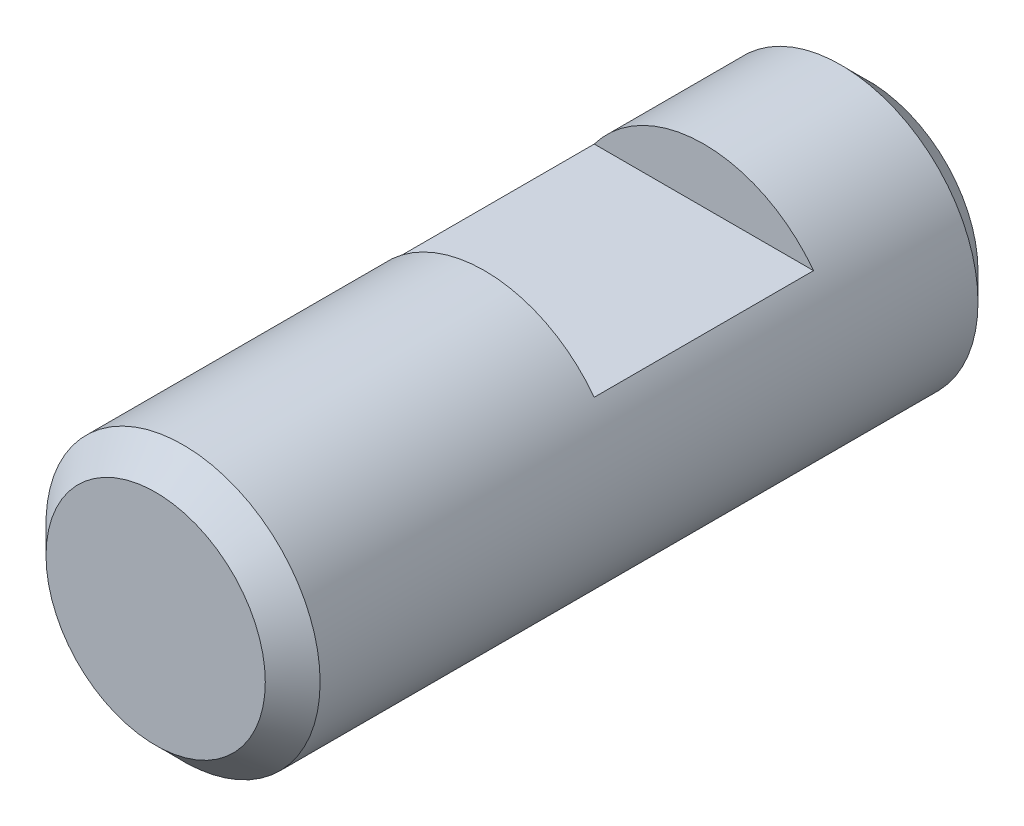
ISO-10303-21;
HEADER;
FILE_DESCRIPTION(('STEP AP214'),'2;1');
FILE_NAME('part.step','',(''),(''),'','','');
FILE_SCHEMA(('AUTOMOTIVE_DESIGN { 1 0 10303 214 1 1 1 1 }'));
ENDSEC;
DATA;
#1=APPLICATION_CONTEXT('core data for automotive mechanical design processes');
#2=APPLICATION_PROTOCOL_DEFINITION('international standard','automotive_design',2000,#1);
#3=PRODUCT_CONTEXT('',#1,'mechanical');
#4=PRODUCT('Part','Part','',(#3));
#5=PRODUCT_RELATED_PRODUCT_CATEGORY('part','',(#4));
#6=PRODUCT_DEFINITION_FORMATION('','',#4);
#7=PRODUCT_DEFINITION_CONTEXT('part definition',#1,'design');
#8=PRODUCT_DEFINITION('design','',#6,#7);
#9=PRODUCT_DEFINITION_SHAPE('','',#8);
#10=(LENGTH_UNIT() NAMED_UNIT(*) SI_UNIT(.MILLI.,.METRE.));
#11=(NAMED_UNIT(*) PLANE_ANGLE_UNIT() SI_UNIT($,.RADIAN.));
#12=(NAMED_UNIT(*) SI_UNIT($,.STERADIAN.) SOLID_ANGLE_UNIT());
#13=UNCERTAINTY_MEASURE_WITH_UNIT(LENGTH_MEASURE(1.E-05),#10,'distance_accuracy_value','');
#14=(GEOMETRIC_REPRESENTATION_CONTEXT(3) GLOBAL_UNCERTAINTY_ASSIGNED_CONTEXT((#13)) GLOBAL_UNIT_ASSIGNED_CONTEXT((#10,
#11,#12)) REPRESENTATION_CONTEXT('',''));
#15=CARTESIAN_POINT('',(0.,0.,0.));
#16=DIRECTION('',(0.,0.,1.));
#17=DIRECTION('',(1.,0.,0.));
#18=AXIS2_PLACEMENT_3D('',#15,#16,#17);
#19=CARTESIAN_POINT('',(0.,0.,26.));
#20=DIRECTION('',(0.,0.,-1.));
#21=DIRECTION('',(-1.,0.,0.));
#22=AXIS2_PLACEMENT_3D('',#19,#20,#21);
#23=CYLINDRICAL_SURFACE('',#22,5.);
#24=CARTESIAN_POINT('',(0.,0.,25.));
#25=DIRECTION('',(0.,0.,1.));
#26=DIRECTION('',(1.,0.,0.));
#27=AXIS2_PLACEMENT_3D('',#24,#25,#26);
#28=CIRCLE('',#27,5.);
#29=CARTESIAN_POINT('',(5.,0.,25.));
#30=VERTEX_POINT('',#29);
#31=EDGE_CURVE('E11',#30,#30,#28,.F.);
#32=ORIENTED_EDGE('',*,*,#31,.T.);
#33=EDGE_LOOP('',(#32));
#34=FACE_BOUND('',#33,.T.);
#35=CARTESIAN_POINT('',(0.,0.,1.00000000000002));
#36=DIRECTION('',(0.,0.,1.));
#37=DIRECTION('',(1.,0.,0.));
#38=AXIS2_PLACEMENT_3D('',#35,#36,#37);
#39=CIRCLE('',#38,5.);
#40=CARTESIAN_POINT('',(5.,0.,1.00000000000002));
#41=VERTEX_POINT('',#40);
#42=EDGE_CURVE('E65',#41,#41,#39,.T.);
#43=ORIENTED_EDGE('',*,*,#42,.T.);
#44=EDGE_LOOP('',(#43));
#45=FACE_BOUND('',#44,.T.);
#46=DIRECTION('',(0.,0.,-1.));
#47=VECTOR('',#46,1.);
#48=CARTESIAN_POINT('',(4.,3.,26.));
#49=LINE('',#48,#47);
#50=CARTESIAN_POINT('',(4.,3.,14.));
#51=VERTEX_POINT('',#50);
#52=CARTESIAN_POINT('',(4.,3.,6.));
#53=VERTEX_POINT('',#52);
#54=EDGE_CURVE('E46',#51,#53,#49,.T.);
#55=ORIENTED_EDGE('',*,*,#54,.F.);
#56=CARTESIAN_POINT('',(0.,0.,14.));
#57=DIRECTION('',(0.,0.,1.));
#58=DIRECTION('',(1.,0.,0.));
#59=AXIS2_PLACEMENT_3D('',#56,#57,#58);
#60=CIRCLE('',#59,5.);
#61=CARTESIAN_POINT('',(-4.,3.,14.));
#62=VERTEX_POINT('',#61);
#63=EDGE_CURVE('E54',#51,#62,#60,.T.);
#64=ORIENTED_EDGE('',*,*,#63,.T.);
#65=DIRECTION('',(0.,0.,-1.));
#66=VECTOR('',#65,1.);
#67=CARTESIAN_POINT('',(-4.,3.,26.));
#68=LINE('',#67,#66);
#69=CARTESIAN_POINT('',(-4.,3.,6.));
#70=VERTEX_POINT('',#69);
#71=EDGE_CURVE('E60',#70,#62,#68,.F.);
#72=ORIENTED_EDGE('',*,*,#71,.F.);
#73=CARTESIAN_POINT('',(0.,0.,6.));
#74=DIRECTION('',(0.,0.,-1.));
#75=DIRECTION('',(-1.,0.,0.));
#76=AXIS2_PLACEMENT_3D('',#73,#74,#75);
#77=CIRCLE('',#76,5.);
#78=EDGE_CURVE('E59',#70,#53,#77,.T.);
#79=ORIENTED_EDGE('',*,*,#78,.T.);
#80=EDGE_LOOP('',(#55,#64,#72,#79));
#81=FACE_BOUND('',#80,.T.);
#82=ADVANCED_FACE('F27',(#34,#45,#81),#23,.T.);
#83=CARTESIAN_POINT('',(0.,0.,26.));
#84=DIRECTION('',(0.,0.,1.));
#85=DIRECTION('',(1.,0.,0.));
#86=AXIS2_PLACEMENT_3D('',#83,#84,#85);
#87=PLANE('',#86);
#88=CARTESIAN_POINT('',(0.,0.,26.));
#89=DIRECTION('',(0.,0.,1.));
#90=DIRECTION('',(1.,0.,0.));
#91=AXIS2_PLACEMENT_3D('',#88,#89,#90);
#92=CIRCLE('',#91,3.99999999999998);
#93=CARTESIAN_POINT('',(3.99999999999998,0.,26.));
#94=VERTEX_POINT('',#93);
#95=EDGE_CURVE('E34',#94,#94,#92,.T.);
#96=ORIENTED_EDGE('',*,*,#95,.T.);
#97=EDGE_LOOP('',(#96));
#98=FACE_BOUND('',#97,.T.);
#99=ADVANCED_FACE('F76',(#98),#87,.T.);
#100=CARTESIAN_POINT('',(0.,0.,0.));
#101=DIRECTION('',(0.,0.,1.));
#102=DIRECTION('',(1.,0.,0.));
#103=AXIS2_PLACEMENT_3D('',#100,#101,#102);
#104=PLANE('',#103);
#105=CARTESIAN_POINT('',(0.,0.,0.));
#106=DIRECTION('',(0.,0.,1.));
#107=DIRECTION('',(1.,0.,0.));
#108=AXIS2_PLACEMENT_3D('',#105,#106,#107);
#109=CIRCLE('',#108,3.99999999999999);
#110=CARTESIAN_POINT('',(3.99999999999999,0.,0.));
#111=VERTEX_POINT('',#110);
#112=EDGE_CURVE('E68',#111,#111,#109,.F.);
#113=ORIENTED_EDGE('',*,*,#112,.T.);
#114=EDGE_LOOP('',(#113));
#115=FACE_BOUND('',#114,.T.);
#116=ADVANCED_FACE('F94',(#115),#104,.F.);
#117=CARTESIAN_POINT('',(-8.,9.,6.));
#118=DIRECTION('',(0.,0.,-1.));
#119=DIRECTION('',(-1.,0.,0.));
#120=AXIS2_PLACEMENT_3D('',#117,#118,#119);
#121=PLANE('',#120);
#122=DIRECTION('',(1.,0.,0.));
#123=VECTOR('',#122,1.);
#124=CARTESIAN_POINT('',(-8.,3.,6.));
#125=LINE('',#124,#123);
#126=EDGE_CURVE('E41',#70,#53,#125,.T.);
#127=ORIENTED_EDGE('',*,*,#126,.T.);
#128=ORIENTED_EDGE('',*,*,#78,.F.);
#129=EDGE_LOOP('',(#127,#128));
#130=FACE_BOUND('',#129,.T.);
#131=ADVANCED_FACE('F101',(#130),#121,.F.);
#132=CARTESIAN_POINT('',(8.,9.,14.));
#133=DIRECTION('',(0.,0.,1.));
#134=DIRECTION('',(1.,0.,0.));
#135=AXIS2_PLACEMENT_3D('',#132,#133,#134);
#136=PLANE('',#135);
#137=DIRECTION('',(-1.,0.,0.));
#138=VECTOR('',#137,1.);
#139=CARTESIAN_POINT('',(8.,3.,14.));
#140=LINE('',#139,#138);
#141=EDGE_CURVE('E56',#51,#62,#140,.T.);
#142=ORIENTED_EDGE('',*,*,#141,.T.);
#143=ORIENTED_EDGE('',*,*,#63,.F.);
#144=EDGE_LOOP('',(#142,#143));
#145=FACE_BOUND('',#144,.T.);
#146=ADVANCED_FACE('F55',(#145),#136,.F.);
#147=CARTESIAN_POINT('',(8.,3.,14.));
#148=DIRECTION('',(0.,1.,0.));
#149=DIRECTION('',(0.,0.,1.));
#150=AXIS2_PLACEMENT_3D('',#147,#148,#149);
#151=PLANE('',#150);
#152=ORIENTED_EDGE('',*,*,#54,.T.);
#153=ORIENTED_EDGE('',*,*,#126,.F.);
#154=ORIENTED_EDGE('',*,*,#71,.T.);
#155=ORIENTED_EDGE('',*,*,#141,.F.);
#156=EDGE_LOOP('',(#152,#153,#154,#155));
#157=FACE_BOUND('',#156,.T.);
#158=ADVANCED_FACE('F62',(#157),#151,.T.);
#159=CARTESIAN_POINT('',(0.,0.,1.00000000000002));
#160=DIRECTION('',(0.,0.,1.));
#161=DIRECTION('',(1.,0.,0.));
#162=AXIS2_PLACEMENT_3D('',#159,#160,#161);
#163=CONICAL_SURFACE('',#162,5.,0.785398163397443);
#164=ORIENTED_EDGE('',*,*,#112,.F.);
#165=EDGE_LOOP('',(#164));
#166=FACE_BOUND('',#165,.T.);
#167=ORIENTED_EDGE('',*,*,#42,.F.);
#168=EDGE_LOOP('',(#167));
#169=FACE_BOUND('',#168,.T.);
#170=ADVANCED_FACE('F80',(#166,#169),#163,.T.);
#171=CARTESIAN_POINT('',(0.,0.,26.));
#172=DIRECTION('',(0.,0.,-1.));
#173=DIRECTION('',(-1.,0.,0.));
#174=AXIS2_PLACEMENT_3D('',#171,#172,#173);
#175=CONICAL_SURFACE('',#174,3.99999999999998,0.785398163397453);
#176=ORIENTED_EDGE('',*,*,#31,.F.);
#177=EDGE_LOOP('',(#176));
#178=FACE_BOUND('',#177,.T.);
#179=ORIENTED_EDGE('',*,*,#95,.F.);
#180=EDGE_LOOP('',(#179));
#181=FACE_BOUND('',#180,.T.);
#182=ADVANCED_FACE('F78',(#178,#181),#175,.T.);
#183=CLOSED_SHELL('',(#82,#99,#116,#131,#146,#158,#170,#182));
#184=MANIFOLD_SOLID_BREP('B2',#183);
#185=ADVANCED_BREP_SHAPE_REPRESENTATION('',(#18,#184),#14);
#186=SHAPE_DEFINITION_REPRESENTATION(#9,#185);
ENDSEC;
END-ISO-10303-21;
